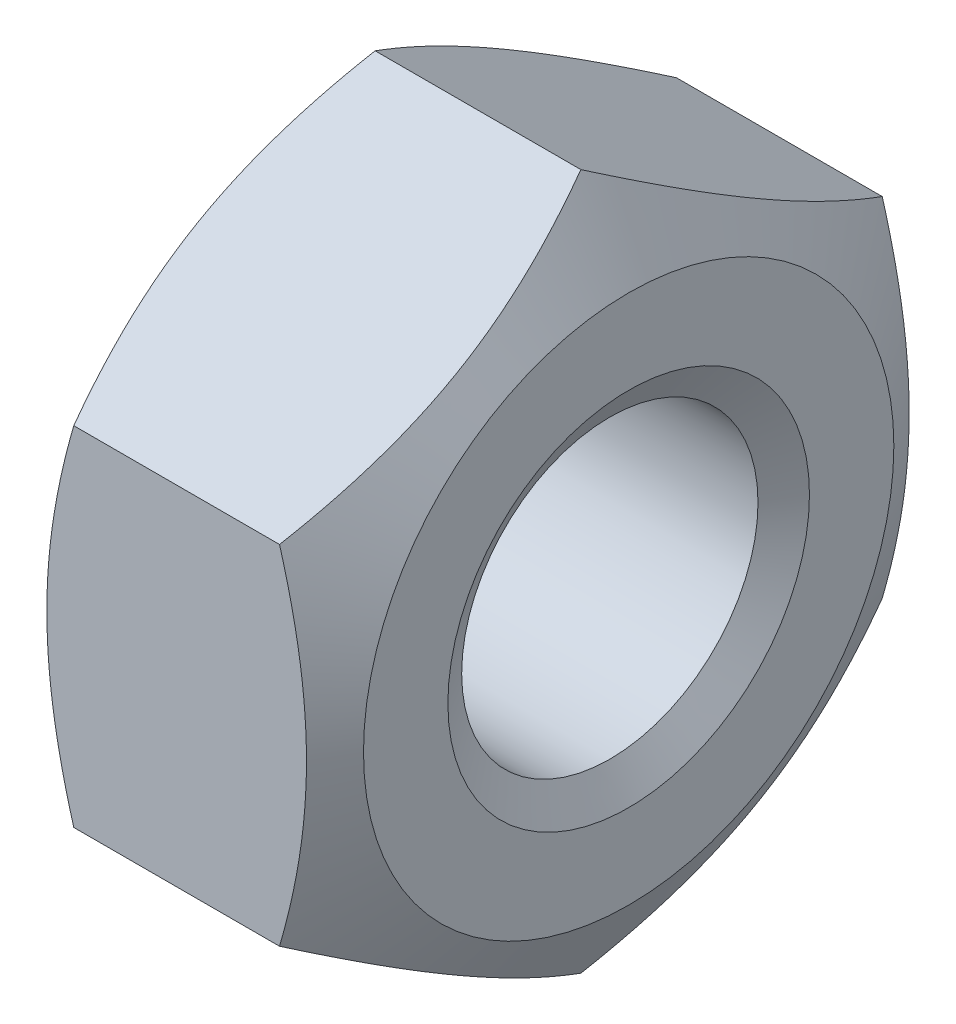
ISO-10303-21;
HEADER;
FILE_DESCRIPTION(('STEP AP214'),'2;1');
FILE_NAME('part.step','',(''),(''),'','','');
FILE_SCHEMA(('AUTOMOTIVE_DESIGN { 1 0 10303 214 1 1 1 1 }'));
ENDSEC;
DATA;
#1=APPLICATION_CONTEXT('core data for automotive mechanical design processes');
#2=APPLICATION_PROTOCOL_DEFINITION('international standard','automotive_design',2000,#1);
#3=PRODUCT_CONTEXT('',#1,'mechanical');
#4=PRODUCT('Part','Part','',(#3));
#5=PRODUCT_RELATED_PRODUCT_CATEGORY('part','',(#4));
#6=PRODUCT_DEFINITION_FORMATION('','',#4);
#7=PRODUCT_DEFINITION_CONTEXT('part definition',#1,'design');
#8=PRODUCT_DEFINITION('design','',#6,#7);
#9=PRODUCT_DEFINITION_SHAPE('','',#8);
#10=(LENGTH_UNIT() NAMED_UNIT(*) SI_UNIT(.MILLI.,.METRE.));
#11=(NAMED_UNIT(*) PLANE_ANGLE_UNIT() SI_UNIT($,.RADIAN.));
#12=(NAMED_UNIT(*) SI_UNIT($,.STERADIAN.) SOLID_ANGLE_UNIT());
#13=UNCERTAINTY_MEASURE_WITH_UNIT(LENGTH_MEASURE(1.E-05),#10,'distance_accuracy_value','');
#14=(GEOMETRIC_REPRESENTATION_CONTEXT(3) GLOBAL_UNCERTAINTY_ASSIGNED_CONTEXT((#13)) GLOBAL_UNIT_ASSIGNED_CONTEXT((#10,
#11,#12)) REPRESENTATION_CONTEXT('',''));
#15=CARTESIAN_POINT('',(0.,0.,0.));
#16=DIRECTION('',(0.,0.,1.));
#17=DIRECTION('',(1.,0.,0.));
#18=AXIS2_PLACEMENT_3D('',#15,#16,#17);
#19=CARTESIAN_POINT('',(0.,-2.88675134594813,5.));
#20=DIRECTION('',(0.,0.,1.));
#21=DIRECTION('',(1.,0.,0.));
#22=AXIS2_PLACEMENT_3D('',#19,#20,#21);
#23=PLANE('',#22);
#24=CARTESIAN_POINT('',(4.20700781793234,2.88675137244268,4.99999996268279));
#25=CARTESIAN_POINT('',(4.2802644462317,2.63302761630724,4.99999998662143));
#26=CARTESIAN_POINT('',(4.34689388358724,2.37713374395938,4.99999999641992));
#27=CARTESIAN_POINT('',(4.46319415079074,1.86091529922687,5.00000000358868));
#28=CARTESIAN_POINT('',(4.51282384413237,1.60058155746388,5.00000000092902));
#29=CARTESIAN_POINT('',(4.59006351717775,1.08310062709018,4.99999999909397));
#30=CARTESIAN_POINT('',(4.61818802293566,0.82603401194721,4.99999999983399));
#31=CARTESIAN_POINT('',(4.64340457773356,0.439530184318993,5.00000000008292));
#32=CARTESIAN_POINT('',(4.64898312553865,0.310607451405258,5.00000000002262));
#33=CARTESIAN_POINT('',(4.6543887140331,0.0526429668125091,4.99999999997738));
#34=CARTESIAN_POINT('',(4.65421593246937,-0.0763987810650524,4.99999999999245));
#35=CARTESIAN_POINT('',(4.64582811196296,-0.429906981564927,5.00000000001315));
#36=CARTESIAN_POINT('',(4.63175086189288,-0.654256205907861,5.00000000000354));
#37=CARTESIAN_POINT('',(4.58711838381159,-1.10146572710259,4.99999999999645));
#38=CARTESIAN_POINT('',(4.55654790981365,-1.32432445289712,4.99999999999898));
#39=CARTESIAN_POINT('',(4.48013216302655,-1.77243444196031,5.00000000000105));
#40=CARTESIAN_POINT('',(4.4339632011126,-1.9976291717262,5.00000000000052));
#41=CARTESIAN_POINT('',(4.32917902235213,-2.44466083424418,4.99999999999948));
#42=CARTESIAN_POINT('',(4.27058841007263,-2.66650348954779,4.99999999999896));
#43=CARTESIAN_POINT('',(4.20700787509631,-2.88675125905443,5.));
#44=B_SPLINE_CURVE_WITH_KNOTS('',3,(#24,#25,#26,#27,#28,#29,#30,#31,#32,#33,#34,#35,#36,#37,#38,
#39,#40,#41,#42,#43),.UNSPECIFIED.,.F.,.F.,(4,2,2,2,2,2,2,2,2,4),(0.,0.792540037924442,
1.58698455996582,2.36176903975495,2.74878736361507,3.13579372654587,3.80946093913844,
4.48375194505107,5.17299549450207,5.86088635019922),.UNSPECIFIED.);
#45=CARTESIAN_POINT('',(4.20700786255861,2.88675136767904,4.99999996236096));
#46=VERTEX_POINT('',#45);
#47=CARTESIAN_POINT('',(4.2070078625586,-2.88675130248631,5.));
#48=VERTEX_POINT('',#47);
#49=EDGE_CURVE('E91',#46,#48,#44,.T.);
#50=ORIENTED_EDGE('',*,*,#49,.F.);
#51=DIRECTION('',(1.,0.,0.));
#52=VECTOR('',#51,1.);
#53=CARTESIAN_POINT('',(0.,2.88675134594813,5.));
#54=LINE('',#53,#52);
#55=CARTESIAN_POINT('',(0.792992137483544,2.88675130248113,5.));
#56=VERTEX_POINT('',#55);
#57=EDGE_CURVE('E79',#56,#46,#54,.T.);
#58=ORIENTED_EDGE('',*,*,#57,.F.);
#59=CARTESIAN_POINT('',(0.792992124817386,-2.88675125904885,5.00000000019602));
#60=CARTESIAN_POINT('',(0.719735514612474,-2.63302750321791,5.00000000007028));
#61=CARTESIAN_POINT('',(0.653106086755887,-2.3771336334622,5.00000000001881));
#62=CARTESIAN_POINT('',(0.536805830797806,-1.86091519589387,4.99999999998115));
#63=CARTESIAN_POINT('',(0.487176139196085,-1.60058145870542,4.99999999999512));
#64=CARTESIAN_POINT('',(0.409936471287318,-1.08310053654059,5.00000000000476));
#65=CARTESIAN_POINT('',(0.381811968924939,-0.826033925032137,5.00000000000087));
#66=CARTESIAN_POINT('',(0.356595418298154,-0.439530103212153,4.99999999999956));
#67=CARTESIAN_POINT('',(0.351016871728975,-0.310607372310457,4.99999999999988));
#68=CARTESIAN_POINT('',(0.3456112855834,-0.0526428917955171,5.00000000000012));
#69=CARTESIAN_POINT('',(0.34578406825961,0.0763988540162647,5.00000000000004));
#70=CARTESIAN_POINT('',(0.35417189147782,0.429907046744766,4.99999999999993));
#71=CARTESIAN_POINT('',(0.368249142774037,0.654256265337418,4.99999999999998));
#72=CARTESIAN_POINT('',(0.41288162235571,1.1014657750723,5.00000000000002));
#73=CARTESIAN_POINT('',(0.443452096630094,1.32432449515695,5.));
#74=CARTESIAN_POINT('',(0.519867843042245,1.77243447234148,4.99999999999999));
#75=CARTESIAN_POINT('',(0.566036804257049,1.99762919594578,5.));
#76=CARTESIAN_POINT('',(0.670820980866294,2.44466084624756,5.));
#77=CARTESIAN_POINT('',(0.729411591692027,2.66650349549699,5.));
#78=CARTESIAN_POINT('',(0.792992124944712,2.88675125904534,5.));
#79=B_SPLINE_CURVE_WITH_KNOTS('',3,(#59,#60,#61,#62,#63,#64,#65,#66,#67,#68,#69,#70,#71,#72,#73,
#74,#75,#76,#77,#78),.UNSPECIFIED.,.F.,.F.,(4,2,2,2,2,2,2,2,2,4),(0.,0.792540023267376,
1.58698453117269,2.36176899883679,2.74878731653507,3.13579367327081,3.8094608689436,
4.48375185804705,5.17299538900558,5.86088622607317),.UNSPECIFIED.);
#80=CARTESIAN_POINT('',(0.792992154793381,-2.88675133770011,5.00000001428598));
#81=VERTEX_POINT('',#80);
#82=EDGE_CURVE('E115',#81,#56,#79,.T.);
#83=ORIENTED_EDGE('',*,*,#82,.F.);
#84=DIRECTION('',(1.,0.,0.));
#85=VECTOR('',#84,1.);
#86=CARTESIAN_POINT('',(0.,-2.88675134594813,5.));
#87=LINE('',#86,#85);
#88=EDGE_CURVE('E94',#48,#81,#87,.F.);
#89=ORIENTED_EDGE('',*,*,#88,.F.);
#90=EDGE_LOOP('',(#50,#58,#83,#89));
#91=FACE_BOUND('',#90,.T.);
#92=ADVANCED_FACE('F15',(#91),#23,.T.);
#93=CARTESIAN_POINT('',(0.,2.88675134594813,5.));
#94=DIRECTION('',(0.,0.866025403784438,0.5));
#95=DIRECTION('',(0.,-0.5,0.866025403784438));
#96=AXIS2_PLACEMENT_3D('',#93,#94,#95);
#97=PLANE('',#96);
#98=CARTESIAN_POINT('',(4.20700787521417,5.77350264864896,7.53102059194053E-08));
#99=CARTESIAN_POINT('',(4.28026448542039,5.64664077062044,0.219731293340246));
#100=CARTESIAN_POINT('',(4.34689391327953,5.51869383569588,0.4413418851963));
#101=CARTESIAN_POINT('',(4.46319416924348,5.26058461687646,0.888400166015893));
#102=CARTESIAN_POINT('',(4.51282386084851,5.13041774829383,1.11385579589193));
#103=CARTESIAN_POINT('',(4.59006352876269,4.87167728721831,1.56200742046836));
#104=CARTESIAN_POINT('',(4.61818803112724,4.7431439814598,1.78463363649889));
#105=CARTESIAN_POINT('',(4.64340458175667,4.54989207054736,2.11935576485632));
#106=CARTESIAN_POINT('',(4.64898312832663,4.48543070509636,2.23100612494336));
#107=CARTESIAN_POINT('',(4.65438871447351,4.35644846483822,2.454409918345));
#108=CARTESIAN_POINT('',(4.65421593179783,4.29192759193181,2.56616334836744));
#109=CARTESIAN_POINT('',(4.64582810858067,4.11517349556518,2.87231042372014));
#110=CARTESIAN_POINT('',(4.63175085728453,4.00299888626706,3.06660254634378));
#111=CARTESIAN_POINT('',(4.58711837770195,3.77939413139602,3.45389734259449));
#112=CARTESIAN_POINT('',(4.55654790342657,3.66796477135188,3.64689865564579));
#113=CARTESIAN_POINT('',(4.48013215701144,3.44390978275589,4.03497327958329));
#114=CARTESIAN_POINT('',(4.43396319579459,3.33131242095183,4.22999763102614));
#115=CARTESIAN_POINT('',(4.32917901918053,3.10779659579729,4.6171383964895));
#116=CARTESIAN_POINT('',(4.27058840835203,2.99687527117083,4.80925976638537));
#117=CARTESIAN_POINT('',(4.20700787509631,2.88675138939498,4.99999992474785));
#118=B_SPLINE_CURVE_WITH_KNOTS('',3,(#98,#99,#100,#101,#102,#103,#104,#105,#106,#107,#108,#109,
#110,#111,#112,#113,#114,#115,#116,#117),.UNSPECIFIED.,.F.,.F.,(4,2,2,2,2,2,2,2,2,4),(0.,
0.792540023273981,1.58698453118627,2.36176899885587,2.74878731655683,3.13579367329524,
3.80946086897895,4.48375185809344,5.17299538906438,5.86088622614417),.UNSPECIFIED.);
#119=CARTESIAN_POINT('',(4.207007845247,5.77350270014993,1.42957854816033E-08));
#120=VERTEX_POINT('',#119);
#121=EDGE_CURVE('E19',#120,#46,#118,.T.);
#122=ORIENTED_EDGE('',*,*,#121,.F.);
#123=DIRECTION('',(1.,0.,0.));
#124=VECTOR('',#123,1.);
#125=CARTESIAN_POINT('',(0.,5.77350269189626,0.));
#126=LINE('',#125,#124);
#127=CARTESIAN_POINT('',(0.79299213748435,5.77350267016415,3.76411070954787E-08));
#128=VERTEX_POINT('',#127);
#129=EDGE_CURVE('E72',#128,#120,#126,.T.);
#130=ORIENTED_EDGE('',*,*,#129,.F.);
#131=CARTESIAN_POINT('',(0.792992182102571,2.88675130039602,5.00000000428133));
#132=CARTESIAN_POINT('',(0.719735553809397,3.01361319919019,4.78026879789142));
#133=CARTESIAN_POINT('',(0.653106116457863,3.14156014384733,4.55865820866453));
#134=CARTESIAN_POINT('',(0.536805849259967,3.39966937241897,4.11159992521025));
#135=CARTESIAN_POINT('',(0.487176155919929,3.52983624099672,3.88614429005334));
#136=CARTESIAN_POINT('',(0.409936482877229,3.78857670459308,3.43799265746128));
#137=CARTESIAN_POINT('',(0.381811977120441,3.91711001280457,3.21536643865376));
#138=CARTESIAN_POINT('',(0.35659542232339,4.11036192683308,2.8806443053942));
#139=CARTESIAN_POINT('',(0.351016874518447,4.17482329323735,2.76899394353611));
#140=CARTESIAN_POINT('',(0.345611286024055,4.30380553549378,2.54559014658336));
#141=CARTESIAN_POINT('',(0.345784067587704,4.36832640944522,2.43383671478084));
#142=CARTESIAN_POINT('',(0.354171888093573,4.5450805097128,2.12768963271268));
#143=CARTESIAN_POINT('',(0.368249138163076,4.65725512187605,1.93339750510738));
#144=CARTESIAN_POINT('',(0.412881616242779,4.88085988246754,1.54610269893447));
#145=CARTESIAN_POINT('',(0.443452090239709,4.99228924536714,1.35310138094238));
#146=CARTESIAN_POINT('',(0.519867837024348,5.21634423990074,0.965026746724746));
#147=CARTESIAN_POINT('',(0.566036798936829,5.3289416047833,0.770002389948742));
#148=CARTESIAN_POINT('',(0.670820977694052,5.5524574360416,0.382861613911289));
#149=CARTESIAN_POINT('',(0.729411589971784,5.6633787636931,0.190740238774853));
#150=CARTESIAN_POINT('',(0.792992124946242,5.77350264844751,7.52554313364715E-08));
#151=B_SPLINE_CURVE_WITH_KNOTS('',3,(#131,#132,#133,#134,#135,#136,#137,#138,#139,#140,#141,
#142,#143,#144,#145,#146,#147,#148,#149,#150),.UNSPECIFIED.,.F.,.F.,(4,2,2,2,2,2,2,2,2,4),(0.,
0.792540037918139,1.58698455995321,2.36176903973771,2.74878736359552,3.13579372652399,
3.80946093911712,4.4837519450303,5.1729954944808,5.86088635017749),.UNSPECIFIED.);
#152=EDGE_CURVE('E82',#56,#128,#151,.T.);
#153=ORIENTED_EDGE('',*,*,#152,.F.);
#154=ORIENTED_EDGE('',*,*,#57,.T.);
#155=EDGE_LOOP('',(#122,#130,#153,#154));
#156=FACE_BOUND('',#155,.T.);
#157=ADVANCED_FACE('F81',(#156),#97,.T.);
#158=CARTESIAN_POINT('',(0.,5.77350269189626,0.));
#159=DIRECTION('',(0.,0.866025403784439,-0.499999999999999));
#160=DIRECTION('',(0.,0.499999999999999,0.866025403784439));
#161=AXIS2_PLACEMENT_3D('',#158,#159,#160);
#162=PLANE('',#161);
#163=CARTESIAN_POINT('',(4.20700781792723,2.88675130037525,-5.00000000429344));
#164=CARTESIAN_POINT('',(4.28026444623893,3.01361319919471,-4.78026879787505));
#165=CARTESIAN_POINT('',(4.34689388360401,3.14156014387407,-4.55865820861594));
#166=CARTESIAN_POINT('',(4.46319415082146,3.39966937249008,-4.11159992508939));
#167=CARTESIAN_POINT('',(4.51282384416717,3.52983624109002,-3.88614428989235));
#168=CARTESIAN_POINT('',(4.59006351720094,3.78857670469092,-3.43799265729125));
#169=CARTESIAN_POINT('',(4.61818802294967,3.91711001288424,-3.21536643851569));
#170=CARTESIAN_POINT('',(4.6434045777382,4.11036192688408,-2.88064430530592));
#171=CARTESIAN_POINT('',(4.64898312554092,4.17482329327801,-2.76899394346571));
#172=CARTESIAN_POINT('',(4.65438871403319,4.30380553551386,-2.54559014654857));
#173=CARTESIAN_POINT('',(4.6542159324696,4.36832640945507,-2.43383671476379));
#174=CARTESIAN_POINT('',(4.64582811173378,4.54508051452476,-2.12768962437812));
#175=CARTESIAN_POINT('',(4.63175086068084,4.65725513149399,-1.93339748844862));
#176=CARTESIAN_POINT('',(4.5871183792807,4.8808599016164,-1.54610266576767));
#177=CARTESIAN_POINT('',(4.55654790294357,4.99228926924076,-1.35310133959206));
#178=CARTESIAN_POINT('',(4.48013215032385,5.21634427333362,-0.9650266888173));
#179=CARTESIAN_POINT('',(4.43396318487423,5.32894164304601,-0.770002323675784));
#180=CARTESIAN_POINT('',(4.32917899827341,5.55245748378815,-0.382861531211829));
#181=CARTESIAN_POINT('',(4.27058838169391,5.6633788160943,-0.190740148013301));
#182=CARTESIAN_POINT('',(4.20700784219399,5.77350270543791,2.34548240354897E-08));
#183=B_SPLINE_CURVE_WITH_KNOTS('',3,(#163,#164,#165,#166,#167,#168,#169,#170,#171,#172,#173,
#174,#175,#176,#177,#178,#179,#180,#181,#182),.UNSPECIFIED.,.F.,.F.,(4,2,2,2,2,2,2,2,2,4),(0.,
0.792540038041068,1.58698456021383,2.36176903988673,2.74878736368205,3.13579372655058,
3.80946096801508,4.48375200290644,5.17299558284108,5.8608864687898),.UNSPECIFIED.);
#184=CARTESIAN_POINT('',(4.20700786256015,2.88675130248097,-5.));
#185=VERTEX_POINT('',#184);
#186=EDGE_CURVE('E93',#185,#120,#183,.T.);
#187=ORIENTED_EDGE('',*,*,#186,.F.);
#188=DIRECTION('',(-1.,0.,0.));
#189=VECTOR('',#188,1.);
#190=CARTESIAN_POINT('',(0.,2.88675134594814,-5.));
#191=LINE('',#190,#189);
#192=CARTESIAN_POINT('',(0.792992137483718,2.88675136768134,-4.99999996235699));
#193=VERTEX_POINT('',#192);
#194=EDGE_CURVE('E188',#193,#185,#191,.F.);
#195=ORIENTED_EDGE('',*,*,#194,.F.);
#196=CARTESIAN_POINT('',(0.792992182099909,5.77350267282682,4.15845169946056E-08));
#197=CARTESIAN_POINT('',(0.719735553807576,5.64664081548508,-0.219731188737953));
#198=CARTESIAN_POINT('',(0.653106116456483,5.51869388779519,-0.441341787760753));
#199=CARTESIAN_POINT('',(0.53680584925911,5.26058467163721,-0.888400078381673));
#200=CARTESIAN_POINT('',(0.487176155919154,5.13041779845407,-1.11385571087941));
#201=CARTESIAN_POINT('',(0.409936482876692,4.87167733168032,-1.56200734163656));
#202=CARTESIAN_POINT('',(0.381811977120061,4.74314402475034,-1.78463356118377));
#203=CARTESIAN_POINT('',(0.356595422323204,4.54989211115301,-2.11935569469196));
#204=CARTESIAN_POINT('',(0.351016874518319,4.48543074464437,-2.23100605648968));
#205=CARTESIAN_POINT('',(0.345611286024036,4.35644850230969,-2.45440985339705));
#206=CARTESIAN_POINT('',(0.345784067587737,4.29192762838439,-2.56616328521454));
#207=CARTESIAN_POINT('',(0.354171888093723,4.11517352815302,-2.87231036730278));
#208=CARTESIAN_POINT('',(0.368249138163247,4.00299891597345,-3.06660249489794));
#209=CARTESIAN_POINT('',(0.412881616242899,3.7793941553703,-3.45389730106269));
#210=CARTESIAN_POINT('',(0.443452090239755,3.66796479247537,-3.64689861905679));
#211=CARTESIAN_POINT('',(0.519867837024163,3.44390979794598,-4.0349732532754));
#212=CARTESIAN_POINT('',(0.566036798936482,3.33131243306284,-4.22999761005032));
#213=CARTESIAN_POINT('',(0.670820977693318,3.10779660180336,-4.61713838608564));
#214=CARTESIAN_POINT('',(0.729411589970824,2.99687527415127,-4.80925976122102));
#215=CARTESIAN_POINT('',(0.792992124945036,2.88675138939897,-4.99999992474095));
#216=B_SPLINE_CURVE_WITH_KNOTS('',3,(#196,#197,#198,#199,#200,#201,#202,#203,#204,#205,#206,
#207,#208,#209,#210,#211,#212,#213,#214,#215),.UNSPECIFIED.,.F.,.F.,(4,2,2,2,2,2,2,2,2,4),(0.,
0.792540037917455,1.58698455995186,2.36176903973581,2.74878736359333,3.13579372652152,
3.8094609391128,4.48375194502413,5.17299549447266,5.86088635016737),.UNSPECIFIED.);
#217=EDGE_CURVE('E158',#128,#193,#216,.T.);
#218=ORIENTED_EDGE('',*,*,#217,.F.);
#219=ORIENTED_EDGE('',*,*,#129,.T.);
#220=EDGE_LOOP('',(#187,#195,#218,#219));
#221=FACE_BOUND('',#220,.T.);
#222=ADVANCED_FACE('F162',(#221),#162,.T.);
#223=CARTESIAN_POINT('',(0.,2.88675134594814,-5.));
#224=DIRECTION('',(0.,0.,-1.));
#225=DIRECTION('',(-1.,0.,0.));
#226=AXIS2_PLACEMENT_3D('',#223,#224,#225);
#227=PLANE('',#226);
#228=CARTESIAN_POINT('',(4.20700781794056,-2.88675137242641,-4.99999996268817));
#229=CARTESIAN_POINT('',(4.28026444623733,-2.63302761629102,-4.99999998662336));
#230=CARTESIAN_POINT('',(4.34689388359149,-2.37713374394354,-4.99999999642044));
#231=CARTESIAN_POINT('',(4.46319415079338,-1.86091529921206,-5.00000000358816));
#232=CARTESIAN_POINT('',(4.51282384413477,-1.60058155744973,-5.00000000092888));
#233=CARTESIAN_POINT('',(4.59006351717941,-1.08310062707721,-4.9999999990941));
#234=CARTESIAN_POINT('',(4.61818802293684,-0.826034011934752,-4.99999999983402));
#235=CARTESIAN_POINT('',(4.64340457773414,-0.439530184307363,-5.00000000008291));
#236=CARTESIAN_POINT('',(4.64898312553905,-0.310607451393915,-5.00000000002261));
#237=CARTESIAN_POINT('',(4.65438871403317,-0.0526429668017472,-4.99999999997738));
#238=CARTESIAN_POINT('',(4.65421593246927,0.0763987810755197,-4.99999999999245));
#239=CARTESIAN_POINT('',(4.6458281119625,0.429906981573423,-5.00000000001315));
#240=CARTESIAN_POINT('',(4.63175086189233,0.654256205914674,-5.00000000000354));
#241=CARTESIAN_POINT('',(4.58711838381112,1.10146572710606,-4.99999999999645));
#242=CARTESIAN_POINT('',(4.55654790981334,1.32432445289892,-4.99999999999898));
#243=CARTESIAN_POINT('',(4.48013216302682,1.7724344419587,-5.00000000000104));
#244=CARTESIAN_POINT('',(4.43396320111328,1.99762917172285,-5.00000000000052));
#245=CARTESIAN_POINT('',(4.32917902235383,2.44466083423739,-4.99999999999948));
#246=CARTESIAN_POINT('',(4.27058841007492,2.66650348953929,-4.99999999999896));
#247=CARTESIAN_POINT('',(4.20700787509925,2.88675125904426,-5.));
#248=B_SPLINE_CURVE_WITH_KNOTS('',3,(#228,#229,#230,#231,#232,#233,#234,#235,#236,#237,#238,
#239,#240,#241,#242,#243,#244,#245,#246,#247),.UNSPECIFIED.,.F.,.F.,(4,2,2,2,2,2,2,2,2,4),(0.,
0.792540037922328,1.58698455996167,2.36176903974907,2.74878736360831,3.13579372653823,
3.80946093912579,4.48375194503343,5.17299549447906,5.86088635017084),.UNSPECIFIED.);
#249=CARTESIAN_POINT('',(4.20700786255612,-2.88675136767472,-4.99999996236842));
#250=VERTEX_POINT('',#249);
#251=EDGE_CURVE('E173',#250,#185,#248,.T.);
#252=ORIENTED_EDGE('',*,*,#251,.F.);
#253=DIRECTION('',(1.,0.,0.));
#254=VECTOR('',#253,1.);
#255=CARTESIAN_POINT('',(0.,-2.88675134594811,-5.00000000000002));
#256=LINE('',#255,#254);
#257=CARTESIAN_POINT('',(0.792992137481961,-2.88675130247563,-5.00000000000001));
#258=VERTEX_POINT('',#257);
#259=EDGE_CURVE('E186',#258,#250,#256,.T.);
#260=ORIENTED_EDGE('',*,*,#259,.F.);
#261=CARTESIAN_POINT('',(0.792992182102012,2.88675137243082,-4.99999996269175));
#262=CARTESIAN_POINT('',(0.719735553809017,2.63302761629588,-4.99999998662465));
#263=CARTESIAN_POINT('',(0.653106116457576,2.37713374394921,-4.99999999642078));
#264=CARTESIAN_POINT('',(0.536805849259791,1.8609152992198,-5.00000000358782));
#265=CARTESIAN_POINT('',(0.487176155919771,1.60058155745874,-5.00000000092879));
#266=CARTESIAN_POINT('',(0.40993648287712,1.08310062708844,-4.99999999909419));
#267=CARTESIAN_POINT('',(0.381811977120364,0.826034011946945,-4.99999999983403));
#268=CARTESIAN_POINT('',(0.356595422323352,0.439530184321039,-5.0000000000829));
#269=CARTESIAN_POINT('',(0.35101687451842,0.310607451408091,-5.00000000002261));
#270=CARTESIAN_POINT('',(0.345611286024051,0.0526429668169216,-4.99999999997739));
#271=CARTESIAN_POINT('',(0.345784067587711,-0.0763987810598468,-4.99999999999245));
#272=CARTESIAN_POINT('',(0.354171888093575,-0.429906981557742,-5.00000000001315));
#273=CARTESIAN_POINT('',(0.368249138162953,-0.6542562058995,-5.00000000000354));
#274=CARTESIAN_POINT('',(0.412881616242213,-1.10146572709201,-4.99999999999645));
#275=CARTESIAN_POINT('',(0.443452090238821,-1.32432445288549,-4.99999999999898));
#276=CARTESIAN_POINT('',(0.519867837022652,-1.77243444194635,-5.00000000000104));
#277=CARTESIAN_POINT('',(0.566036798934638,-1.99762917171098,-5.00000000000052));
#278=CARTESIAN_POINT('',(0.670820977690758,-2.44466083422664,-4.99999999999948));
#279=CARTESIAN_POINT('',(0.729411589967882,-2.6665034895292,-4.99999999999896));
#280=CARTESIAN_POINT('',(0.792992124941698,-2.8867512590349,-5.));
#281=B_SPLINE_CURVE_WITH_KNOTS('',3,(#261,#262,#263,#264,#265,#266,#267,#268,#269,#270,#271,
#272,#273,#274,#275,#276,#277,#278,#279,#280),.UNSPECIFIED.,.F.,.F.,(4,2,2,2,2,2,2,2,2,4),(0.,
0.792540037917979,1.5869845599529,2.3617690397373,2.74878736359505,3.13579372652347,
3.80946093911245,4.48375194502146,5.17299549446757,5.8608863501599),.UNSPECIFIED.);
#282=EDGE_CURVE('E153',#193,#258,#281,.T.);
#283=ORIENTED_EDGE('',*,*,#282,.F.);
#284=ORIENTED_EDGE('',*,*,#194,.T.);
#285=EDGE_LOOP('',(#252,#260,#283,#284));
#286=FACE_BOUND('',#285,.T.);
#287=ADVANCED_FACE('F165',(#286),#227,.T.);
#288=CARTESIAN_POINT('',(0.,-2.88675134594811,-5.00000000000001));
#289=DIRECTION('',(0.,-0.866025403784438,-0.500000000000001));
#290=DIRECTION('',(0.,0.500000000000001,-0.866025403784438));
#291=AXIS2_PLACEMENT_3D('',#288,#289,#290);
#292=PLANE('',#291);
#293=CARTESIAN_POINT('',(4.20700781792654,-5.77350267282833,4.16154109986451E-08));
#294=CARTESIAN_POINT('',(4.28026444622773,-5.64664081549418,-0.219731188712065));
#295=CARTESIAN_POINT('',(4.34689388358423,-5.51869388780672,-0.441341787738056));
#296=CARTESIAN_POINT('',(4.46319415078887,-5.26058467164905,-0.888400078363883));
#297=CARTESIAN_POINT('',(4.51282384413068,-5.13041779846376,-1.11385571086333));
#298=CARTESIAN_POINT('',(4.59006351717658,-4.87167733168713,-1.56200734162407));
#299=CARTESIAN_POINT('',(4.61818802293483,-4.74314402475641,-1.78463356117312));
#300=CARTESIAN_POINT('',(4.64340457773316,-4.54989211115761,-2.11935569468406));
#301=CARTESIAN_POINT('',(4.64898312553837,-4.48543074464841,-2.23100605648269));
#302=CARTESIAN_POINT('',(4.65438871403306,-4.35644850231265,-2.4544098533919));
#303=CARTESIAN_POINT('',(4.65421593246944,-4.29192762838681,-2.56616328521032));
#304=CARTESIAN_POINT('',(4.64582811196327,-4.11517352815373,-2.87231036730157));
#305=CARTESIAN_POINT('',(4.63175086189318,-4.00299891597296,-3.06660249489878));
#306=CARTESIAN_POINT('',(4.58711838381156,-3.7793941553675,-3.45389730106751));
#307=CARTESIAN_POINT('',(4.55654790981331,-3.66796479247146,-3.64689861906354));
#308=CARTESIAN_POINT('',(4.48013216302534,-3.44390979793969,-4.03497325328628));
#309=CARTESIAN_POINT('',(4.43396320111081,-3.33131243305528,-4.22999761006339));
#310=CARTESIAN_POINT('',(4.329179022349,-3.10779660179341,-4.61713838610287));
#311=CARTESIAN_POINT('',(4.27058841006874,-2.99687527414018,-4.80925976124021));
#312=CARTESIAN_POINT('',(4.20700787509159,-2.8867513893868,-4.99999992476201));
#313=B_SPLINE_CURVE_WITH_KNOTS('',3,(#293,#294,#295,#296,#297,#298,#299,#300,#301,#302,#303,
#304,#305,#306,#307,#308,#309,#310,#311,#312),.UNSPECIFIED.,.F.,.F.,(4,2,2,2,2,2,2,2,2,4),(0.,
0.792540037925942,1.58698455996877,2.36176903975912,2.74878736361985,3.13579372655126,
3.80946093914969,4.48375194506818,5.17299549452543,5.86088635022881),.UNSPECIFIED.);
#314=CARTESIAN_POINT('',(4.20700786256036,-5.77350267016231,3.76442992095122E-08));
#315=VERTEX_POINT('',#314);
#316=EDGE_CURVE('E97',#315,#250,#313,.T.);
#317=ORIENTED_EDGE('',*,*,#316,.F.);
#318=DIRECTION('',(1.,0.,0.));
#319=VECTOR('',#318,1.);
#320=CARTESIAN_POINT('',(0.,-5.77350269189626,0.));
#321=LINE('',#320,#319);
#322=CARTESIAN_POINT('',(0.792992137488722,-5.77350267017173,-3.76279899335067E-08));
#323=VERTEX_POINT('',#322);
#324=EDGE_CURVE('E190',#323,#315,#321,.T.);
#325=ORIENTED_EDGE('',*,*,#324,.F.);
#326=CARTESIAN_POINT('',(0.792992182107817,-2.88675130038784,-5.00000000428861));
#327=CARTESIAN_POINT('',(0.719735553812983,-3.01361319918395,-4.78026879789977));
#328=CARTESIAN_POINT('',(0.653106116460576,-3.14156014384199,-4.55865820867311));
#329=CARTESIAN_POINT('',(0.536805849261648,-3.39966937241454,-4.11159992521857));
#330=CARTESIAN_POINT('',(0.48717615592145,-3.5298362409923,-3.88614429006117));
#331=CARTESIAN_POINT('',(0.409936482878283,-3.78857670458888,-3.43799265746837));
#332=CARTESIAN_POINT('',(0.381811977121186,-3.9171100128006,-3.21536643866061));
#333=CARTESIAN_POINT('',(0.356595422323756,-4.11036192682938,-2.88064430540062));
#334=CARTESIAN_POINT('',(0.3510168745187,-4.17482329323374,-2.76899394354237));
#335=CARTESIAN_POINT('',(0.345611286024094,-4.30380553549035,-2.5455901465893));
#336=CARTESIAN_POINT('',(0.345784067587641,-4.36832640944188,-2.43383671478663));
#337=CARTESIAN_POINT('',(0.354171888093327,-4.54508050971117,-2.12768963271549));
#338=CARTESIAN_POINT('',(0.368249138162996,-4.65725512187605,-1.93339750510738));
#339=CARTESIAN_POINT('',(0.412881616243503,-4.88085988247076,-1.54610269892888));
#340=CARTESIAN_POINT('',(0.44345209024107,-4.99228924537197,-1.35310138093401));
#341=CARTESIAN_POINT('',(0.519867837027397,-5.21634423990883,-0.965026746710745));
#342=CARTESIAN_POINT('',(0.566036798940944,-5.32894160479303,-0.77000238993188));
#343=CARTESIAN_POINT('',(0.670820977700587,-5.55245743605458,-0.382861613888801));
#344=CARTESIAN_POINT('',(0.729411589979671,-5.66337876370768,-0.1907402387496));
#345=CARTESIAN_POINT('',(0.792992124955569,-5.77350264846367,-7.52274510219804E-08));
#346=B_SPLINE_CURVE_WITH_KNOTS('',3,(#326,#327,#328,#329,#330,#331,#332,#333,#334,#335,#336,
#337,#338,#339,#340,#341,#342,#343,#344,#345),.UNSPECIFIED.,.F.,.F.,(4,2,2,2,2,2,2,2,2,4),(0.,
0.792540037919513,1.58698455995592,2.36176903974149,2.74878736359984,3.13579372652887,
3.80946093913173,4.48375194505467,5.1729954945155,5.86088635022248),.UNSPECIFIED.);
#347=EDGE_CURVE('E39',#258,#323,#346,.T.);
#348=ORIENTED_EDGE('',*,*,#347,.F.);
#349=ORIENTED_EDGE('',*,*,#259,.T.);
#350=EDGE_LOOP('',(#317,#325,#348,#349));
#351=FACE_BOUND('',#350,.T.);
#352=ADVANCED_FACE('F169',(#351),#292,.T.);
#353=CARTESIAN_POINT('',(0.,-5.77350269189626,0.));
#354=DIRECTION('',(0.,-0.866025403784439,0.5));
#355=DIRECTION('',(0.,-0.5,-0.866025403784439));
#356=AXIS2_PLACEMENT_3D('',#353,#354,#355);
#357=PLANE('',#356);
#358=CARTESIAN_POINT('',(4.20700781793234,-2.8867513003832,5.00000000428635));
#359=CARTESIAN_POINT('',(4.2802644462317,-3.0136131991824,4.78026879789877));
#360=CARTESIAN_POINT('',(4.34689388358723,-3.14156014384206,4.55865820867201));
#361=CARTESIAN_POINT('',(4.46319415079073,-3.39966937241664,4.11159992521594));
#362=CARTESIAN_POINT('',(4.51282384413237,-3.5298362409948,3.88614429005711));
#363=CARTESIAN_POINT('',(4.59006351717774,-3.78857670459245,3.43799265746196));
#364=CARTESIAN_POINT('',(4.61818802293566,-3.91711001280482,3.21536643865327));
#365=CARTESIAN_POINT('',(4.64340457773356,-4.11036192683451,2.88064430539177));
#366=CARTESIAN_POINT('',(4.64898312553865,-4.17482329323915,2.76899394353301));
#367=CARTESIAN_POINT('',(4.6543887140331,-4.30380553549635,2.54559014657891));
#368=CARTESIAN_POINT('',(4.65421593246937,-4.36832640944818,2.43383671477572));
#369=CARTESIAN_POINT('',(4.64582811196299,-4.54508050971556,2.1276896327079));
#370=CARTESIAN_POINT('',(4.631750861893,-4.65725512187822,1.93339750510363));
#371=CARTESIAN_POINT('',(4.58711838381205,-4.88085988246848,1.54610269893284));
#372=CARTESIAN_POINT('',(4.55654790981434,-4.99228924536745,1.35310138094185));
#373=CARTESIAN_POINT('',(4.48013216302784,-5.21634423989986,0.965026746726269));
#374=CARTESIAN_POINT('',(4.43396320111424,-5.32894160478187,0.77000238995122));
#375=CARTESIAN_POINT('',(4.32917902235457,-5.55245743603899,0.382861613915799));
#376=CARTESIAN_POINT('',(4.27058841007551,-5.66337876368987,0.190740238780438));
#377=CARTESIAN_POINT('',(4.20700787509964,-5.77350264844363,7.52621534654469E-08));
#378=B_SPLINE_CURVE_WITH_KNOTS('',3,(#358,#359,#360,#361,#362,#363,#364,#365,#366,#367,#368,
#369,#370,#371,#372,#373,#374,#375,#376,#377),.UNSPECIFIED.,.F.,.F.,(4,2,2,2,2,2,2,2,2,4),(0.,
0.79254003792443,1.58698455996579,2.36176903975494,2.74878736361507,3.13579372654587,
3.80946093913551,4.48375194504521,5.17299549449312,5.8608863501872),.UNSPECIFIED.);
#379=EDGE_CURVE('E96',#48,#315,#378,.T.);
#380=ORIENTED_EDGE('',*,*,#379,.F.);
#381=ORIENTED_EDGE('',*,*,#88,.T.);
#382=CARTESIAN_POINT('',(0.792992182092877,-5.77350267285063,-4.15897635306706E-08));
#383=CARTESIAN_POINT('',(0.719735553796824,-5.64664081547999,0.219731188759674));
#384=CARTESIAN_POINT('',(0.65310611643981,-5.51869388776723,0.441341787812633));
#385=CARTESIAN_POINT('',(0.53680584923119,-5.26058467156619,0.888400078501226));
#386=CARTESIAN_POINT('',(0.487176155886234,-5.13041779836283,1.11385571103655));
#387=CARTESIAN_POINT('',(0.409936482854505,-4.8716773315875,1.5620073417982));
#388=CARTESIAN_POINT('',(0.381811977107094,-4.74314402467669,1.78463356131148));
#389=CARTESIAN_POINT('',(0.356595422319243,-4.54989211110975,2.11935569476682));
#390=CARTESIAN_POINT('',(0.35101687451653,-4.48543074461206,2.23100605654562));
#391=CARTESIAN_POINT('',(0.345611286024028,-4.35644850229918,2.45440985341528));
#392=CARTESIAN_POINT('',(0.345784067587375,-4.29192762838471,2.56616328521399));
#393=CARTESIAN_POINT('',(0.354171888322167,-4.11517352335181,2.87231037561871));
#394=CARTESIAN_POINT('',(0.368249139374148,-4.00299890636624,3.06660251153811));
#395=CARTESIAN_POINT('',(0.412881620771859,-3.77939413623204,3.45389733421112));
#396=CARTESIAN_POINT('',(0.443452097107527,-3.66796476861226,3.6468986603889));
#397=CARTESIAN_POINT('',(0.519867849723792,-3.44390976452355,4.03497331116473));
#398=CARTESIAN_POINT('',(0.566036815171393,-3.33131239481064,4.22999767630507));
#399=CARTESIAN_POINT('',(0.670821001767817,-3.10779655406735,4.61713846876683));
#400=CARTESIAN_POINT('',(0.729411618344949,-2.99687522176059,4.80925985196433));
#401=CARTESIAN_POINT('',(0.792992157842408,-2.88675133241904,5.00000002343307));
#402=B_SPLINE_CURVE_WITH_KNOTS('',3,(#382,#383,#384,#385,#386,#387,#388,#389,#390,#391,#392,
#393,#394,#395,#396,#397,#398,#399,#400,#401),.UNSPECIFIED.,.F.,.F.,(4,2,2,2,2,2,2,2,2,4),(0.,
0.792540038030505,1.58698456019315,2.36176903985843,2.74878736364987,3.13579372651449,
3.80946096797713,4.48375200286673,5.17299558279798,5.8608864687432),.UNSPECIFIED.);
#403=EDGE_CURVE('E141',#323,#81,#402,.T.);
#404=ORIENTED_EDGE('',*,*,#403,.F.);
#405=ORIENTED_EDGE('',*,*,#324,.T.);
#406=EDGE_LOOP('',(#380,#381,#404,#405));
#407=FACE_BOUND('',#406,.T.);
#408=ADVANCED_FACE('F209',(#407),#357,.T.);
#409=CARTESIAN_POINT('',(4.20224989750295,0.,0.));
#410=DIRECTION('',(-1.,0.,0.));
#411=DIRECTION('',(0.,0.,1.));
#412=AXIS2_PLACEMENT_3D('',#409,#410,#411);
#413=CONICAL_SURFACE('',#412,5.78174370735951,1.04719754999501);
#414=CARTESIAN_POINT('',(5.00000000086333,0.,0.));
#415=DIRECTION('',(-1.,0.,0.));
#416=DIRECTION('',(0.,0.,1.));
#417=AXIS2_PLACEMENT_3D('',#414,#415,#416);
#418=CIRCLE('',#417,4.40000000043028);
#419=CARTESIAN_POINT('',(5.00000000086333,0.,4.40000000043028));
#420=VERTEX_POINT('',#419);
#421=EDGE_CURVE('E203',#420,#420,#418,.F.);
#422=ORIENTED_EDGE('',*,*,#421,.F.);
#423=EDGE_LOOP('',(#422));
#424=FACE_BOUND('',#423,.T.);
#425=ORIENTED_EDGE('',*,*,#251,.T.);
#426=ORIENTED_EDGE('',*,*,#186,.T.);
#427=ORIENTED_EDGE('',*,*,#121,.T.);
#428=ORIENTED_EDGE('',*,*,#49,.T.);
#429=ORIENTED_EDGE('',*,*,#379,.T.);
#430=ORIENTED_EDGE('',*,*,#316,.T.);
#431=EDGE_LOOP('',(#425,#426,#427,#428,#429,#430));
#432=FACE_BOUND('',#431,.T.);
#433=ADVANCED_FACE('F89',(#424,#432),#413,.T.);
#434=CARTESIAN_POINT('',(0.797750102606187,0.,0.));
#435=DIRECTION('',(1.,0.,0.));
#436=DIRECTION('',(0.,0.,-1.));
#437=AXIS2_PLACEMENT_3D('',#434,#435,#436);
#438=CONICAL_SURFACE('',#437,5.7817437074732,1.04719755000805);
#439=CARTESIAN_POINT('',(-7.95807647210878E-10,0.,0.));
#440=DIRECTION('',(1.,0.,0.));
#441=DIRECTION('',(0.,0.,-1.));
#442=AXIS2_PLACEMENT_3D('',#439,#440,#441);
#443=CIRCLE('',#442,4.40000000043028);
#444=CARTESIAN_POINT('',(-7.95807647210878E-10,0.,-4.40000000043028));
#445=VERTEX_POINT('',#444);
#446=EDGE_CURVE('E201',#445,#445,#443,.T.);
#447=ORIENTED_EDGE('',*,*,#446,.T.);
#448=EDGE_LOOP('',(#447));
#449=FACE_BOUND('',#448,.T.);
#450=ORIENTED_EDGE('',*,*,#347,.T.);
#451=ORIENTED_EDGE('',*,*,#403,.T.);
#452=ORIENTED_EDGE('',*,*,#82,.T.);
#453=ORIENTED_EDGE('',*,*,#152,.T.);
#454=ORIENTED_EDGE('',*,*,#217,.T.);
#455=ORIENTED_EDGE('',*,*,#282,.T.);
#456=EDGE_LOOP('',(#450,#451,#452,#453,#454,#455));
#457=FACE_BOUND('',#456,.T.);
#458=ADVANCED_FACE('F129',(#449,#457),#438,.T.);
#459=CARTESIAN_POINT('',(5.,0.,0.));
#460=DIRECTION('',(1.,0.,0.));
#461=DIRECTION('',(0.,0.,-1.));
#462=AXIS2_PLACEMENT_3D('',#459,#460,#461);
#463=PLANE('',#462);
#464=CARTESIAN_POINT('',(5.00000000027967,0.,0.));
#465=DIRECTION('',(1.,0.,0.));
#466=DIRECTION('',(0.,0.,-1.));
#467=AXIS2_PLACEMENT_3D('',#464,#465,#466);
#468=CIRCLE('',#467,2.99976587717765);
#469=CARTESIAN_POINT('',(5.00000000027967,0.,-2.99976587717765));
#470=VERTEX_POINT('',#469);
#471=EDGE_CURVE('E198',#470,#470,#468,.F.);
#472=ORIENTED_EDGE('',*,*,#471,.T.);
#473=EDGE_LOOP('',(#472));
#474=FACE_BOUND('',#473,.T.);
#475=ORIENTED_EDGE('',*,*,#421,.T.);
#476=EDGE_LOOP('',(#475));
#477=FACE_BOUND('',#476,.T.);
#478=ADVANCED_FACE('F133',(#474,#477),#463,.T.);
#479=CARTESIAN_POINT('',(0.,0.,0.));
#480=DIRECTION('',(1.,0.,0.));
#481=DIRECTION('',(0.,0.,-1.));
#482=AXIS2_PLACEMENT_3D('',#479,#480,#481);
#483=PLANE('',#482);
#484=CARTESIAN_POINT('',(-3.41060513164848E-10,0.,0.));
#485=DIRECTION('',(-1.,0.,0.));
#486=DIRECTION('',(0.,0.,1.));
#487=AXIS2_PLACEMENT_3D('',#484,#485,#486);
#488=CIRCLE('',#487,2.99976587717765);
#489=CARTESIAN_POINT('',(-3.41060513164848E-10,0.,2.99976587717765));
#490=VERTEX_POINT('',#489);
#491=EDGE_CURVE('E195',#490,#490,#488,.F.);
#492=ORIENTED_EDGE('',*,*,#491,.T.);
#493=EDGE_LOOP('',(#492));
#494=FACE_BOUND('',#493,.T.);
#495=ORIENTED_EDGE('',*,*,#446,.F.);
#496=EDGE_LOOP('',(#495));
#497=FACE_BOUND('',#496,.T.);
#498=ADVANCED_FACE('F235',(#494,#497),#483,.F.);
#499=CARTESIAN_POINT('',(5.00000000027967,0.,0.));
#500=DIRECTION('',(1.,0.,0.));
#501=DIRECTION('',(0.,0.,-1.));
#502=AXIS2_PLACEMENT_3D('',#499,#500,#501);
#503=CONICAL_SURFACE('',#502,2.99976587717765,1.04719755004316);
#504=ORIENTED_EDGE('',*,*,#471,.F.);
#505=EDGE_LOOP('',(#504));
#506=FACE_BOUND('',#505,.T.);
#507=CARTESIAN_POINT('',(4.6875,0.,0.));
#508=DIRECTION('',(-1.,0.,0.));
#509=DIRECTION('',(0.,-1.,0.));
#510=AXIS2_PLACEMENT_3D('',#507,#508,#509);
#511=CIRCLE('',#510,2.4585);
#512=CARTESIAN_POINT('',(4.6875,-2.4585,0.));
#513=VERTEX_POINT('',#512);
#514=EDGE_CURVE('E30',#513,#513,#511,.T.);
#515=ORIENTED_EDGE('',*,*,#514,.T.);
#516=EDGE_LOOP('',(#515));
#517=FACE_BOUND('',#516,.T.);
#518=ADVANCED_FACE('F219',(#506,#517),#503,.F.);
#519=CARTESIAN_POINT('',(-3.41060513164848E-10,0.,0.));
#520=DIRECTION('',(-1.,0.,0.));
#521=DIRECTION('',(0.,0.,1.));
#522=AXIS2_PLACEMENT_3D('',#519,#520,#521);
#523=CONICAL_SURFACE('',#522,2.99976587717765,1.04719755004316);
#524=ORIENTED_EDGE('',*,*,#491,.F.);
#525=EDGE_LOOP('',(#524));
#526=FACE_BOUND('',#525,.T.);
#527=CARTESIAN_POINT('',(0.3125,0.,0.));
#528=DIRECTION('',(1.,0.,0.));
#529=DIRECTION('',(0.,1.,0.));
#530=AXIS2_PLACEMENT_3D('',#527,#528,#529);
#531=CIRCLE('',#530,2.4585);
#532=CARTESIAN_POINT('',(0.3125,2.4585,0.));
#533=VERTEX_POINT('',#532);
#534=EDGE_CURVE('E10',#533,#533,#531,.T.);
#535=ORIENTED_EDGE('',*,*,#534,.T.);
#536=EDGE_LOOP('',(#535));
#537=FACE_BOUND('',#536,.T.);
#538=ADVANCED_FACE('F222',(#526,#537),#523,.F.);
#539=CARTESIAN_POINT('',(4.6875,0.,0.));
#540=DIRECTION('',(-1.,0.,0.));
#541=DIRECTION('',(0.,-1.,0.));
#542=AXIS2_PLACEMENT_3D('',#539,#540,#541);
#543=CYLINDRICAL_SURFACE('',#542,2.4585);
#544=ORIENTED_EDGE('',*,*,#534,.F.);
#545=EDGE_LOOP('',(#544));
#546=FACE_BOUND('',#545,.T.);
#547=ORIENTED_EDGE('',*,*,#514,.F.);
#548=EDGE_LOOP('',(#547));
#549=FACE_BOUND('',#548,.T.);
#550=ADVANCED_FACE('F17',(#546,#549),#543,.F.);
#551=CLOSED_SHELL('',(#92,#157,#222,#287,#352,#408,#433,#458,#478,#498,#518,#538,#550));
#552=MANIFOLD_SOLID_BREP('B1',#551);
#553=ADVANCED_BREP_SHAPE_REPRESENTATION('',(#18,#552),#14);
#554=SHAPE_DEFINITION_REPRESENTATION(#9,#553);
ENDSEC;
END-ISO-10303-21;
